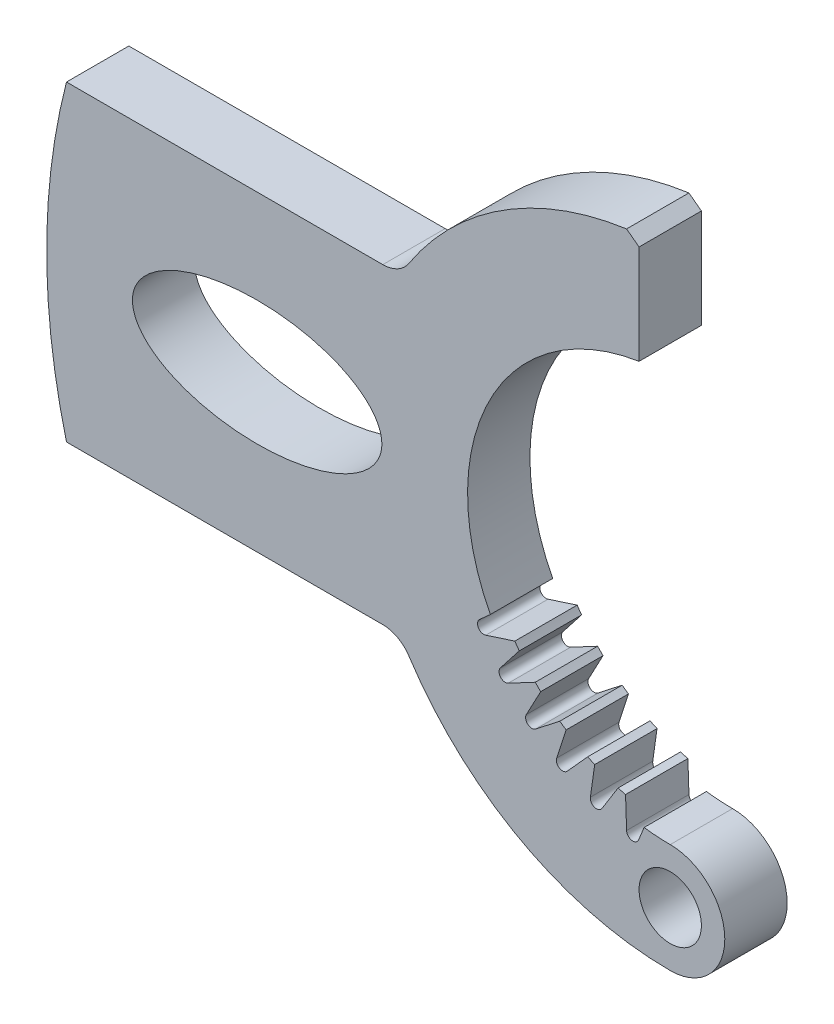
ISO-10303-21;
HEADER;
FILE_DESCRIPTION(('STEP AP214'),'2;1');
FILE_NAME('part.step','',(''),(''),'','','');
FILE_SCHEMA(('AUTOMOTIVE_DESIGN { 1 0 10303 214 1 1 1 1 }'));
ENDSEC;
DATA;
#1=APPLICATION_CONTEXT('core data for automotive mechanical design processes');
#2=APPLICATION_PROTOCOL_DEFINITION('international standard','automotive_design',2000,#1);
#3=PRODUCT_CONTEXT('',#1,'mechanical');
#4=PRODUCT('Part','Part','',(#3));
#5=PRODUCT_RELATED_PRODUCT_CATEGORY('part','',(#4));
#6=PRODUCT_DEFINITION_FORMATION('','',#4);
#7=PRODUCT_DEFINITION_CONTEXT('part definition',#1,'design');
#8=PRODUCT_DEFINITION('design','',#6,#7);
#9=PRODUCT_DEFINITION_SHAPE('','',#8);
#10=(LENGTH_UNIT() NAMED_UNIT(*) SI_UNIT(.MILLI.,.METRE.));
#11=(NAMED_UNIT(*) PLANE_ANGLE_UNIT() SI_UNIT($,.RADIAN.));
#12=(NAMED_UNIT(*) SI_UNIT($,.STERADIAN.) SOLID_ANGLE_UNIT());
#13=UNCERTAINTY_MEASURE_WITH_UNIT(LENGTH_MEASURE(1.E-05),#10,'distance_accuracy_value','');
#14=(GEOMETRIC_REPRESENTATION_CONTEXT(3) GLOBAL_UNCERTAINTY_ASSIGNED_CONTEXT((#13)) GLOBAL_UNIT_ASSIGNED_CONTEXT((#10,
#11,#12)) REPRESENTATION_CONTEXT('',''));
#15=CARTESIAN_POINT('',(0.,0.,0.));
#16=DIRECTION('',(0.,0.,1.));
#17=DIRECTION('',(1.,0.,0.));
#18=AXIS2_PLACEMENT_3D('',#15,#16,#17);
#19=CARTESIAN_POINT('',(96.8245836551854,25.,10.));
#20=DIRECTION('',(0.,0.,1.));
#21=DIRECTION('',(1.,0.,0.));
#22=AXIS2_PLACEMENT_3D('',#19,#20,#21);
#23=PLANE('',#22);
#24=CARTESIAN_POINT('',(30.5745836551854,25.,10.));
#25=DIRECTION('',(0.,0.,1.));
#26=DIRECTION('',(1.,0.,0.));
#27=AXIS2_PLACEMENT_3D('',#24,#25,#26);
#28=ELLIPSE('',#27,20.,10.);
#29=CARTESIAN_POINT('',(50.5745836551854,25.,10.));
#30=VERTEX_POINT('',#29);
#31=EDGE_CURVE('E296',#30,#30,#28,.T.);
#32=ORIENTED_EDGE('',*,*,#31,.F.);
#33=EDGE_LOOP('',(#32));
#34=FACE_BOUND('',#33,.T.);
#35=CARTESIAN_POINT('',(96.8245836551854,25.,10.));
#36=DIRECTION('',(0.,0.,1.));
#37=DIRECTION('',(1.,0.,0.));
#38=AXIS2_PLACEMENT_3D('',#35,#36,#37);
#39=CIRCLE('',#38,100.);
#40=CARTESIAN_POINT('',(0.,50.,10.));
#41=VERTEX_POINT('',#40);
#42=CARTESIAN_POINT('',(0.,0.,10.));
#43=VERTEX_POINT('',#42);
#44=EDGE_CURVE('E361',#41,#43,#39,.T.);
#45=ORIENTED_EDGE('',*,*,#44,.T.);
#46=DIRECTION('',(1.,0.,0.));
#47=VECTOR('',#46,1.);
#48=CARTESIAN_POINT('',(0.,0.,10.));
#49=LINE('',#48,#47);
#50=CARTESIAN_POINT('',(50.726861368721,0.,10.));
#51=VERTEX_POINT('',#50);
#52=EDGE_CURVE('E174',#43,#51,#49,.T.);
#53=ORIENTED_EDGE('',*,*,#52,.T.);
#54=CARTESIAN_POINT('',(50.726861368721,-5.,10.));
#55=DIRECTION('',(0.,0.,-1.));
#56=DIRECTION('',(-1.,0.,0.));
#57=AXIS2_PLACEMENT_3D('',#54,#55,#56);
#58=CIRCLE('',#57,5.);
#59=CARTESIAN_POINT('',(54.9175633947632,-2.27272727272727,10.));
#60=VERTEX_POINT('',#59);
#61=EDGE_CURVE('E457',#51,#60,#58,.T.);
#62=ORIENTED_EDGE('',*,*,#61,.T.);
#63=CARTESIAN_POINT('',(96.8245836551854,25.,10.));
#64=DIRECTION('',(0.,0.,1.));
#65=DIRECTION('',(1.,0.,0.));
#66=AXIS2_PLACEMENT_3D('',#63,#64,#65);
#67=CIRCLE('',#66,50.);
#68=CARTESIAN_POINT('',(96.8245836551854,-25.,10.));
#69=VERTEX_POINT('',#68);
#70=EDGE_CURVE('E476',#60,#69,#67,.T.);
#71=ORIENTED_EDGE('',*,*,#70,.T.);
#72=CARTESIAN_POINT('',(96.8245836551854,-16.25,10.));
#73=DIRECTION('',(0.,0.,1.));
#74=DIRECTION('',(-1.,0.,0.));
#75=AXIS2_PLACEMENT_3D('',#72,#73,#74);
#76=CIRCLE('',#75,8.74999999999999);
#77=CARTESIAN_POINT('',(96.8245836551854,-7.49999999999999,10.));
#78=VERTEX_POINT('',#77);
#79=EDGE_CURVE('E473',#69,#78,#76,.T.);
#80=ORIENTED_EDGE('',*,*,#79,.T.);
#81=CARTESIAN_POINT('',(96.8245836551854,25.,10.));
#82=DIRECTION('',(0.,0.,-1.));
#83=DIRECTION('',(1.,0.,0.));
#84=AXIS2_PLACEMENT_3D('',#81,#82,#83);
#85=CIRCLE('',#84,32.5);
#86=CARTESIAN_POINT('',(92.6259341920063,-7.22764873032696,10.));
#87=VERTEX_POINT('',#86);
#88=EDGE_CURVE('E475',#78,#87,#85,.T.);
#89=ORIENTED_EDGE('',*,*,#88,.T.);
#90=DIRECTION('',(-0.374606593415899,-0.927183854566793,0.));
#91=VECTOR('',#90,1.);
#92=CARTESIAN_POINT('',(91.755212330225,-9.38276096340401,10.));
#93=LINE('',#92,#91);
#94=CARTESIAN_POINT('',(91.755212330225,-9.38276096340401,10.));
#95=VERTEX_POINT('',#94);
#96=EDGE_CURVE('E478',#87,#95,#93,.T.);
#97=ORIENTED_EDGE('',*,*,#96,.T.);
#98=CARTESIAN_POINT('',(90.8280284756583,-9.00815436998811,10.));
#99=DIRECTION('',(0.,0.,-1.));
#100=DIRECTION('',(1.,0.,0.));
#101=AXIS2_PLACEMENT_3D('',#98,#99,#100);
#102=CIRCLE('',#101,0.999999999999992);
#103=CARTESIAN_POINT('',(89.8286376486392,-9.04305386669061,10.));
#104=VERTEX_POINT('',#103);
#105=EDGE_CURVE('E484',#95,#104,#102,.T.);
#106=ORIENTED_EDGE('',*,*,#105,.T.);
#107=DIRECTION('',(-0.0348994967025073,0.999390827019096,0.));
#108=VECTOR('',#107,1.);
#109=CARTESIAN_POINT('',(89.6571122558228,-4.13120927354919,10.));
#110=LINE('',#109,#108);
#111=CARTESIAN_POINT('',(89.6571122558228,-4.13120927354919,10.));
#112=VERTEX_POINT('',#111);
#113=EDGE_CURVE('E486',#104,#112,#110,.T.);
#114=ORIENTED_EDGE('',*,*,#113,.T.);
#115=CARTESIAN_POINT('',(96.8245836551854,25.,10.));
#116=DIRECTION('',(0.,0.,-1.));
#117=DIRECTION('',(1.,0.,0.));
#118=AXIS2_PLACEMENT_3D('',#115,#116,#117);
#119=CIRCLE('',#118,30.);
#120=CARTESIAN_POINT('',(88.4661913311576,-3.81210297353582,10.));
#121=VERTEX_POINT('',#120);
#122=EDGE_CURVE('E488',#112,#121,#119,.T.);
#123=ORIENTED_EDGE('',*,*,#122,.T.);
#124=DIRECTION('',(-0.529919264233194,-0.848048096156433,0.));
#125=VECTOR('',#124,1.);
#126=CARTESIAN_POINT('',(85.8617236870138,-7.98012247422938,10.));
#127=LINE('',#126,#125);
#128=CARTESIAN_POINT('',(85.8617236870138,-7.98012247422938,10.));
#129=VERTEX_POINT('',#128);
#130=EDGE_CURVE('E490',#121,#129,#127,.T.);
#131=ORIENTED_EDGE('',*,*,#130,.T.);
#132=CARTESIAN_POINT('',(85.0136755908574,-7.45020320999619,10.));
#133=DIRECTION('',(0.,0.,-1.));
#134=DIRECTION('',(1.,0.,0.));
#135=AXIS2_PLACEMENT_3D('',#132,#133,#134);
#136=CIRCLE('',#135,0.999999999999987);
#137=CARTESIAN_POINT('',(84.0234075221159,-7.31103010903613,10.));
#138=VERTEX_POINT('',#137);
#139=EDGE_CURVE('E492',#129,#138,#136,.T.);
#140=ORIENTED_EDGE('',*,*,#139,.T.);
#141=DIRECTION('',(0.139173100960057,0.990268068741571,0.));
#142=VECTOR('',#141,1.);
#143=CARTESIAN_POINT('',(84.707420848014,-2.4440224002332,10.));
#144=LINE('',#143,#142);
#145=CARTESIAN_POINT('',(84.707420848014,-2.4440224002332,10.));
#146=VERTEX_POINT('',#145);
#147=EDGE_CURVE('E494',#138,#146,#144,.T.);
#148=ORIENTED_EDGE('',*,*,#147,.T.);
#149=CARTESIAN_POINT('',(96.8245836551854,25.,10.));
#150=DIRECTION('',(0.,0.,-1.));
#151=DIRECTION('',(1.,0.,0.));
#152=AXIS2_PLACEMENT_3D('',#149,#150,#151);
#153=CIRCLE('',#152,30.);
#154=CARTESIAN_POINT('',(83.5900052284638,-1.92296294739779,10.));
#155=VERTEX_POINT('',#154);
#156=EDGE_CURVE('E496',#146,#155,#153,.T.);
#157=ORIENTED_EDGE('',*,*,#156,.T.);
#158=DIRECTION('',(-0.66913065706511,-0.743144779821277,0.));
#159=VECTOR('',#158,1.);
#160=CARTESIAN_POINT('',(83.5900052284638,-1.92296294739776,10.));
#161=LINE('',#160,#159);
#162=CARTESIAN_POINT('',(80.3013359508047,-5.57539970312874,10.));
#163=VERTEX_POINT('',#162);
#164=EDGE_CURVE('E498',#155,#163,#161,.T.);
#165=ORIENTED_EDGE('',*,*,#164,.T.);
#166=CARTESIAN_POINT('',(79.5581911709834,-4.90626904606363,10.));
#167=DIRECTION('',(0.,0.,-1.));
#168=DIRECTION('',(1.,0.,0.));
#169=AXIS2_PLACEMENT_3D('',#166,#167,#168);
#170=CIRCLE('',#169,0.999999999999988);
#171=CARTESIAN_POINT('',(78.6071346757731,-4.59725198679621,10.));
#172=VERTEX_POINT('',#171);
#173=EDGE_CURVE('E500',#163,#172,#170,.T.);
#174=ORIENTED_EDGE('',*,*,#173,.T.);
#175=DIRECTION('',(0.309017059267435,0.951056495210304,0.));
#176=VECTOR('',#175,1.);
#177=CARTESIAN_POINT('',(80.125903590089,0.0770370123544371,10.));
#178=LINE('',#177,#176);
#179=CARTESIAN_POINT('',(80.125903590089,0.0770370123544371,10.));
#180=VERTEX_POINT('',#179);
#181=EDGE_CURVE('E502',#172,#180,#178,.T.);
#182=ORIENTED_EDGE('',*,*,#181,.T.);
#183=CARTESIAN_POINT('',(96.8245836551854,25.,10.));
#184=DIRECTION('',(0.,0.,-1.));
#185=DIRECTION('',(1.,0.,0.));
#186=AXIS2_PLACEMENT_3D('',#183,#184,#185);
#187=CIRCLE('',#186,30.);
#188=CARTESIAN_POINT('',(79.1159444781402,0.784217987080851,10.));
#189=VERTEX_POINT('',#188);
#190=EDGE_CURVE('E504',#180,#189,#187,.T.);
#191=ORIENTED_EDGE('',*,*,#190,.T.);
#192=DIRECTION('',(-0.788010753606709,-0.615661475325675,0.));
#193=VECTOR('',#192,1.);
#194=CARTESIAN_POINT('',(75.2429988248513,-2.24165878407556,10.));
#195=LINE('',#194,#193);
#196=CARTESIAN_POINT('',(75.2429988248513,-2.24165878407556,10.));
#197=VERTEX_POINT('',#196);
#198=EDGE_CURVE('E506',#189,#197,#195,.T.);
#199=ORIENTED_EDGE('',*,*,#198,.T.);
#200=CARTESIAN_POINT('',(74.6273373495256,-1.4536480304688,10.));
#201=DIRECTION('',(0.,0.,-1.));
#202=DIRECTION('',(1.,0.,0.));
#203=AXIS2_PLACEMENT_3D('',#200,#201,#202);
#204=CIRCLE('',#203,1.00000000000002);
#205=CARTESIAN_POINT('',(73.7443897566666,-0.984176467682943,10.));
#206=VERTEX_POINT('',#205);
#207=EDGE_CURVE('E508',#197,#206,#204,.T.);
#208=ORIENTED_EDGE('',*,*,#207,.T.);
#209=DIRECTION('',(0.469471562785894,0.882947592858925,0.));
#210=VECTOR('',#209,1.);
#211=CARTESIAN_POINT('',(76.0517667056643,3.35536842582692,10.));
#212=LINE('',#211,#210);
#213=CARTESIAN_POINT('',(76.0517667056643,3.35536842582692,10.));
#214=VERTEX_POINT('',#213);
#215=EDGE_CURVE('E510',#206,#214,#212,.T.);
#216=ORIENTED_EDGE('',*,*,#215,.T.);
#217=CARTESIAN_POINT('',(96.824583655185,25.0000000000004,10.));
#218=DIRECTION('',(0.,0.,-1.));
#219=DIRECTION('',(1.,0.,0.));
#220=AXIS2_PLACEMENT_3D('',#217,#218,#219);
#221=CIRCLE('',#220,30.);
#222=CARTESIAN_POINT('',(75.1799520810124,4.22718305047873,10.));
#223=VERTEX_POINT('',#222);
#224=EDGE_CURVE('E512',#214,#223,#221,.T.);
#225=ORIENTED_EDGE('',*,*,#224,.T.);
#226=DIRECTION('',(-0.882947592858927,-0.469471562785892,0.));
#227=VECTOR('',#226,1.);
#228=CARTESIAN_POINT('',(70.8404071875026,1.91980610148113,10.));
#229=LINE('',#228,#227);
#230=CARTESIAN_POINT('',(70.8404071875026,1.91980610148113,10.));
#231=VERTEX_POINT('',#230);
#232=EDGE_CURVE('E514',#223,#231,#229,.T.);
#233=ORIENTED_EDGE('',*,*,#232,.T.);
#234=CARTESIAN_POINT('',(70.3709356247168,2.80275369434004,10.));
#235=DIRECTION('',(0.,0.,-1.));
#236=DIRECTION('',(1.,0.,0.));
#237=AXIS2_PLACEMENT_3D('',#234,#235,#236);
#238=CIRCLE('',#237,0.999999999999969);
#239=CARTESIAN_POINT('',(69.58292487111,3.41841516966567,10.));
#240=VERTEX_POINT('',#239);
#241=EDGE_CURVE('E516',#231,#240,#238,.T.);
#242=ORIENTED_EDGE('',*,*,#241,.T.);
#243=DIRECTION('',(0.615661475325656,0.788010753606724,0.));
#244=VECTOR('',#243,1.);
#245=CARTESIAN_POINT('',(72.6088016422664,7.29136082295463,10.));
#246=LINE('',#245,#244);
#247=CARTESIAN_POINT('',(72.6088016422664,7.29136082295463,10.));
#248=VERTEX_POINT('',#247);
#249=EDGE_CURVE('E518',#240,#248,#246,.T.);
#250=ORIENTED_EDGE('',*,*,#249,.T.);
#251=CARTESIAN_POINT('',(96.8245836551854,25.,10.));
#252=DIRECTION('',(0.,0.,-1.));
#253=DIRECTION('',(1.,0.,0.));
#254=AXIS2_PLACEMENT_3D('',#251,#252,#253);
#255=CIRCLE('',#254,30.);
#256=CARTESIAN_POINT('',(71.901620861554,8.30131964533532,10.));
#257=VERTEX_POINT('',#256);
#258=EDGE_CURVE('E520',#248,#257,#255,.T.);
#259=ORIENTED_EDGE('',*,*,#258,.T.);
#260=DIRECTION('',(-0.951056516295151,-0.309016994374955,0.));
#261=VECTOR('',#260,1.);
#262=CARTESIAN_POINT('',(67.2273316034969,6.7825509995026,10.));
#263=LINE('',#262,#261);
#264=CARTESIAN_POINT('',(67.2273316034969,6.7825509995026,10.));
#265=VERTEX_POINT('',#264);
#266=EDGE_CURVE('E522',#257,#265,#263,.T.);
#267=ORIENTED_EDGE('',*,*,#266,.T.);
#268=CARTESIAN_POINT('',(66.9183146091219,7.73360751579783,10.));
#269=DIRECTION('',(0.,0.,-1.));
#270=DIRECTION('',(1.,0.,0.));
#271=AXIS2_PLACEMENT_3D('',#268,#269,#270);
#272=CIRCLE('',#271,1.00000000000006);
#273=CARTESIAN_POINT('',(66.249184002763,8.47675234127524,10.));
#274=VERTEX_POINT('',#273);
#275=EDGE_CURVE('E524',#265,#274,#272,.T.);
#276=ORIENTED_EDGE('',*,*,#275,.T.);
#277=DIRECTION('',(0.743144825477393,0.66913060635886,0.));
#278=VECTOR('',#277,1.);
#279=CARTESIAN_POINT('',(67.9765226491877,10.032055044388,10.));
#280=LINE('',#279,#278);
#281=CARTESIAN_POINT('',(67.9765226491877,10.032055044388,10.));
#282=VERTEX_POINT('',#281);
#283=EDGE_CURVE('E526',#274,#282,#280,.T.);
#284=ORIENTED_EDGE('',*,*,#283,.T.);
#285=CARTESIAN_POINT('',(96.8245836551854,25.,10.));
#286=DIRECTION('',(0.,0.,-1.));
#287=DIRECTION('',(1.,0.,0.));
#288=AXIS2_PLACEMENT_3D('',#285,#286,#287);
#289=CIRCLE('',#288,32.5);
#290=CARTESIAN_POINT('',(91.8245836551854,57.1130814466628,10.));
#291=VERTEX_POINT('',#290);
#292=EDGE_CURVE('E528',#282,#291,#289,.T.);
#293=ORIENTED_EDGE('',*,*,#292,.T.);
#294=DIRECTION('',(0.,1.,0.));
#295=VECTOR('',#294,1.);
#296=CARTESIAN_POINT('',(91.8245836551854,73.,10.));
#297=LINE('',#296,#295);
#298=CARTESIAN_POINT('',(91.8245836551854,73.,10.));
#299=VERTEX_POINT('',#298);
#300=EDGE_CURVE('E530',#291,#299,#297,.T.);
#301=ORIENTED_EDGE('',*,*,#300,.T.);
#302=DIRECTION('',(-0.798545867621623,0.60193396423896,0.));
#303=VECTOR('',#302,1.);
#304=CARTESIAN_POINT('',(89.8245836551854,74.5075751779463,10.));
#305=LINE('',#304,#303);
#306=CARTESIAN_POINT('',(89.8245836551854,74.5075751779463,10.));
#307=VERTEX_POINT('',#306);
#308=EDGE_CURVE('E274',#299,#307,#305,.T.);
#309=ORIENTED_EDGE('',*,*,#308,.T.);
#310=CARTESIAN_POINT('',(96.8245836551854,25.,10.));
#311=DIRECTION('',(0.,0.,1.));
#312=DIRECTION('',(1.,0.,0.));
#313=AXIS2_PLACEMENT_3D('',#310,#311,#312);
#314=CIRCLE('',#313,50.);
#315=CARTESIAN_POINT('',(54.9175633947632,52.2727272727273,10.));
#316=VERTEX_POINT('',#315);
#317=EDGE_CURVE('E268',#307,#316,#314,.T.);
#318=ORIENTED_EDGE('',*,*,#317,.T.);
#319=CARTESIAN_POINT('',(50.726861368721,55.,10.));
#320=DIRECTION('',(0.,0.,-1.));
#321=DIRECTION('',(1.,0.,0.));
#322=AXIS2_PLACEMENT_3D('',#319,#320,#321);
#323=CIRCLE('',#322,4.99999999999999);
#324=CARTESIAN_POINT('',(50.726861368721,50.,10.));
#325=VERTEX_POINT('',#324);
#326=EDGE_CURVE('E272',#316,#325,#323,.T.);
#327=ORIENTED_EDGE('',*,*,#326,.T.);
#328=DIRECTION('',(-1.,0.,0.));
#329=VECTOR('',#328,1.);
#330=CARTESIAN_POINT('',(0.,50.,10.));
#331=LINE('',#330,#329);
#332=EDGE_CURVE('E50',#325,#41,#331,.T.);
#333=ORIENTED_EDGE('',*,*,#332,.T.);
#334=EDGE_LOOP('',(#45,#53,#62,#71,#80,#89,#97,#106,#114,#123,#131,#140,#148,#157,#165,#174,
#182,#191,#199,#208,#216,#225,#233,#242,#250,#259,#267,#276,#284,#293,#301,#309,#318,#327,#333));
#335=FACE_BOUND('',#334,.T.);
#336=CARTESIAN_POINT('',(96.8245836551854,-16.25,10.));
#337=DIRECTION('',(0.,0.,1.));
#338=DIRECTION('',(1.,0.,0.));
#339=AXIS2_PLACEMENT_3D('',#336,#337,#338);
#340=CIRCLE('',#339,5.);
#341=CARTESIAN_POINT('',(101.824583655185,-16.25,10.));
#342=VERTEX_POINT('',#341);
#343=EDGE_CURVE('E575',#342,#342,#340,.T.);
#344=ORIENTED_EDGE('',*,*,#343,.F.);
#345=EDGE_LOOP('',(#344));
#346=FACE_BOUND('',#345,.T.);
#347=ADVANCED_FACE('F33',(#34,#335,#346),#23,.T.);
#348=CARTESIAN_POINT('',(96.8245836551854,25.,0.));
#349=DIRECTION('',(0.,0.,1.));
#350=DIRECTION('',(1.,0.,0.));
#351=AXIS2_PLACEMENT_3D('',#348,#349,#350);
#352=PLANE('',#351);
#353=CARTESIAN_POINT('',(96.8245836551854,25.,0.));
#354=DIRECTION('',(0.,0.,1.));
#355=DIRECTION('',(1.,0.,0.));
#356=AXIS2_PLACEMENT_3D('',#353,#354,#355);
#357=CIRCLE('',#356,100.);
#358=CARTESIAN_POINT('',(0.,50.,0.));
#359=VERTEX_POINT('',#358);
#360=CARTESIAN_POINT('',(0.,0.,0.));
#361=VERTEX_POINT('',#360);
#362=EDGE_CURVE('E292',#359,#361,#357,.T.);
#363=ORIENTED_EDGE('',*,*,#362,.F.);
#364=DIRECTION('',(-1.,0.,0.));
#365=VECTOR('',#364,1.);
#366=CARTESIAN_POINT('',(0.,50.,0.));
#367=LINE('',#366,#365);
#368=CARTESIAN_POINT('',(50.726861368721,50.,0.));
#369=VERTEX_POINT('',#368);
#370=EDGE_CURVE('E166',#369,#359,#367,.T.);
#371=ORIENTED_EDGE('',*,*,#370,.F.);
#372=CARTESIAN_POINT('',(50.726861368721,55.,0.));
#373=DIRECTION('',(0.,0.,-1.));
#374=DIRECTION('',(1.,0.,0.));
#375=AXIS2_PLACEMENT_3D('',#372,#373,#374);
#376=CIRCLE('',#375,4.99999999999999);
#377=CARTESIAN_POINT('',(54.9175633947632,52.2727272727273,0.));
#378=VERTEX_POINT('',#377);
#379=EDGE_CURVE('E160',#378,#369,#376,.T.);
#380=ORIENTED_EDGE('',*,*,#379,.F.);
#381=CARTESIAN_POINT('',(96.8245836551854,25.,0.));
#382=DIRECTION('',(0.,0.,1.));
#383=DIRECTION('',(1.,0.,0.));
#384=AXIS2_PLACEMENT_3D('',#381,#382,#383);
#385=CIRCLE('',#384,50.);
#386=CARTESIAN_POINT('',(89.8245836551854,74.5075751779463,0.));
#387=VERTEX_POINT('',#386);
#388=EDGE_CURVE('E282',#387,#378,#385,.T.);
#389=ORIENTED_EDGE('',*,*,#388,.F.);
#390=DIRECTION('',(-0.798545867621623,0.60193396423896,0.));
#391=VECTOR('',#390,1.);
#392=CARTESIAN_POINT('',(89.8245836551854,74.5075751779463,0.));
#393=LINE('',#392,#391);
#394=CARTESIAN_POINT('',(91.8245836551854,73.,0.));
#395=VERTEX_POINT('',#394);
#396=EDGE_CURVE('E356',#395,#387,#393,.T.);
#397=ORIENTED_EDGE('',*,*,#396,.F.);
#398=DIRECTION('',(0.,1.,0.));
#399=VECTOR('',#398,1.);
#400=CARTESIAN_POINT('',(91.8245836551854,73.,0.));
#401=LINE('',#400,#399);
#402=CARTESIAN_POINT('',(91.8245836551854,57.1130814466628,0.));
#403=VERTEX_POINT('',#402);
#404=EDGE_CURVE('E354',#403,#395,#401,.T.);
#405=ORIENTED_EDGE('',*,*,#404,.F.);
#406=CARTESIAN_POINT('',(96.8245836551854,25.,0.));
#407=DIRECTION('',(0.,0.,-1.));
#408=DIRECTION('',(1.,0.,0.));
#409=AXIS2_PLACEMENT_3D('',#406,#407,#408);
#410=CIRCLE('',#409,32.5);
#411=CARTESIAN_POINT('',(67.9765226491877,10.032055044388,0.));
#412=VERTEX_POINT('',#411);
#413=EDGE_CURVE('E352',#412,#403,#410,.T.);
#414=ORIENTED_EDGE('',*,*,#413,.F.);
#415=DIRECTION('',(0.743144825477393,0.66913060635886,0.));
#416=VECTOR('',#415,1.);
#417=CARTESIAN_POINT('',(67.9765226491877,10.032055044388,0.));
#418=LINE('',#417,#416);
#419=CARTESIAN_POINT('',(66.249184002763,8.47675234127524,0.));
#420=VERTEX_POINT('',#419);
#421=EDGE_CURVE('E350',#420,#412,#418,.T.);
#422=ORIENTED_EDGE('',*,*,#421,.F.);
#423=CARTESIAN_POINT('',(66.9183146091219,7.73360751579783,0.));
#424=DIRECTION('',(0.,0.,-1.));
#425=DIRECTION('',(1.,0.,0.));
#426=AXIS2_PLACEMENT_3D('',#423,#424,#425);
#427=CIRCLE('',#426,1.00000000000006);
#428=CARTESIAN_POINT('',(67.2273316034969,6.7825509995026,0.));
#429=VERTEX_POINT('',#428);
#430=EDGE_CURVE('E348',#429,#420,#427,.T.);
#431=ORIENTED_EDGE('',*,*,#430,.F.);
#432=DIRECTION('',(-0.951056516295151,-0.309016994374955,0.));
#433=VECTOR('',#432,1.);
#434=CARTESIAN_POINT('',(67.2273316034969,6.7825509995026,0.));
#435=LINE('',#434,#433);
#436=CARTESIAN_POINT('',(71.901620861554,8.30131964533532,0.));
#437=VERTEX_POINT('',#436);
#438=EDGE_CURVE('E346',#437,#429,#435,.T.);
#439=ORIENTED_EDGE('',*,*,#438,.F.);
#440=CARTESIAN_POINT('',(96.8245836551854,25.,0.));
#441=DIRECTION('',(0.,0.,-1.));
#442=DIRECTION('',(1.,0.,0.));
#443=AXIS2_PLACEMENT_3D('',#440,#441,#442);
#444=CIRCLE('',#443,30.);
#445=CARTESIAN_POINT('',(72.6088016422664,7.29136082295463,0.));
#446=VERTEX_POINT('',#445);
#447=EDGE_CURVE('E344',#446,#437,#444,.T.);
#448=ORIENTED_EDGE('',*,*,#447,.F.);
#449=DIRECTION('',(0.615661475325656,0.788010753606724,0.));
#450=VECTOR('',#449,1.);
#451=CARTESIAN_POINT('',(72.6088016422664,7.29136082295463,0.));
#452=LINE('',#451,#450);
#453=CARTESIAN_POINT('',(69.58292487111,3.41841516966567,0.));
#454=VERTEX_POINT('',#453);
#455=EDGE_CURVE('E342',#454,#446,#452,.T.);
#456=ORIENTED_EDGE('',*,*,#455,.F.);
#457=CARTESIAN_POINT('',(70.3709356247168,2.80275369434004,0.));
#458=DIRECTION('',(0.,0.,-1.));
#459=DIRECTION('',(1.,0.,0.));
#460=AXIS2_PLACEMENT_3D('',#457,#458,#459);
#461=CIRCLE('',#460,0.999999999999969);
#462=CARTESIAN_POINT('',(70.8404071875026,1.91980610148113,0.));
#463=VERTEX_POINT('',#462);
#464=EDGE_CURVE('E340',#463,#454,#461,.T.);
#465=ORIENTED_EDGE('',*,*,#464,.F.);
#466=DIRECTION('',(-0.882947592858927,-0.469471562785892,0.));
#467=VECTOR('',#466,1.);
#468=CARTESIAN_POINT('',(70.8404071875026,1.91980610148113,0.));
#469=LINE('',#468,#467);
#470=CARTESIAN_POINT('',(75.1799520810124,4.22718305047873,0.));
#471=VERTEX_POINT('',#470);
#472=EDGE_CURVE('E338',#471,#463,#469,.T.);
#473=ORIENTED_EDGE('',*,*,#472,.F.);
#474=CARTESIAN_POINT('',(96.824583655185,25.0000000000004,0.));
#475=DIRECTION('',(0.,0.,-1.));
#476=DIRECTION('',(1.,0.,0.));
#477=AXIS2_PLACEMENT_3D('',#474,#475,#476);
#478=CIRCLE('',#477,30.);
#479=CARTESIAN_POINT('',(76.0517667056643,3.35536842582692,0.));
#480=VERTEX_POINT('',#479);
#481=EDGE_CURVE('E336',#480,#471,#478,.T.);
#482=ORIENTED_EDGE('',*,*,#481,.F.);
#483=DIRECTION('',(0.469471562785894,0.882947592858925,0.));
#484=VECTOR('',#483,1.);
#485=CARTESIAN_POINT('',(76.0517667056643,3.35536842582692,0.));
#486=LINE('',#485,#484);
#487=CARTESIAN_POINT('',(73.7443897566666,-0.984176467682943,0.));
#488=VERTEX_POINT('',#487);
#489=EDGE_CURVE('E334',#488,#480,#486,.T.);
#490=ORIENTED_EDGE('',*,*,#489,.F.);
#491=CARTESIAN_POINT('',(74.6273373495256,-1.4536480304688,0.));
#492=DIRECTION('',(0.,0.,-1.));
#493=DIRECTION('',(1.,0.,0.));
#494=AXIS2_PLACEMENT_3D('',#491,#492,#493);
#495=CIRCLE('',#494,1.00000000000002);
#496=CARTESIAN_POINT('',(75.2429988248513,-2.24165878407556,0.));
#497=VERTEX_POINT('',#496);
#498=EDGE_CURVE('E332',#497,#488,#495,.T.);
#499=ORIENTED_EDGE('',*,*,#498,.F.);
#500=DIRECTION('',(-0.788010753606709,-0.615661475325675,0.));
#501=VECTOR('',#500,1.);
#502=CARTESIAN_POINT('',(75.2429988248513,-2.24165878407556,0.));
#503=LINE('',#502,#501);
#504=CARTESIAN_POINT('',(79.1159444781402,0.784217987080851,0.));
#505=VERTEX_POINT('',#504);
#506=EDGE_CURVE('E330',#505,#497,#503,.T.);
#507=ORIENTED_EDGE('',*,*,#506,.F.);
#508=CARTESIAN_POINT('',(96.8245836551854,25.,0.));
#509=DIRECTION('',(0.,0.,-1.));
#510=DIRECTION('',(1.,0.,0.));
#511=AXIS2_PLACEMENT_3D('',#508,#509,#510);
#512=CIRCLE('',#511,30.);
#513=CARTESIAN_POINT('',(80.125903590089,0.0770370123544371,0.));
#514=VERTEX_POINT('',#513);
#515=EDGE_CURVE('E328',#514,#505,#512,.T.);
#516=ORIENTED_EDGE('',*,*,#515,.F.);
#517=DIRECTION('',(0.309017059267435,0.951056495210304,0.));
#518=VECTOR('',#517,1.);
#519=CARTESIAN_POINT('',(80.125903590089,0.0770370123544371,0.));
#520=LINE('',#519,#518);
#521=CARTESIAN_POINT('',(78.6071346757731,-4.59725198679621,0.));
#522=VERTEX_POINT('',#521);
#523=EDGE_CURVE('E326',#522,#514,#520,.T.);
#524=ORIENTED_EDGE('',*,*,#523,.F.);
#525=CARTESIAN_POINT('',(79.5581911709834,-4.90626904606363,0.));
#526=DIRECTION('',(0.,0.,-1.));
#527=DIRECTION('',(1.,0.,0.));
#528=AXIS2_PLACEMENT_3D('',#525,#526,#527);
#529=CIRCLE('',#528,0.999999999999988);
#530=CARTESIAN_POINT('',(80.3013359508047,-5.57539970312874,0.));
#531=VERTEX_POINT('',#530);
#532=EDGE_CURVE('E324',#531,#522,#529,.T.);
#533=ORIENTED_EDGE('',*,*,#532,.F.);
#534=DIRECTION('',(-0.66913065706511,-0.743144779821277,0.));
#535=VECTOR('',#534,1.);
#536=CARTESIAN_POINT('',(83.5900052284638,-1.92296294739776,0.));
#537=LINE('',#536,#535);
#538=CARTESIAN_POINT('',(83.5900052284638,-1.92296294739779,0.));
#539=VERTEX_POINT('',#538);
#540=EDGE_CURVE('E322',#539,#531,#537,.T.);
#541=ORIENTED_EDGE('',*,*,#540,.F.);
#542=CARTESIAN_POINT('',(96.8245836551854,25.,0.));
#543=DIRECTION('',(0.,0.,-1.));
#544=DIRECTION('',(1.,0.,0.));
#545=AXIS2_PLACEMENT_3D('',#542,#543,#544);
#546=CIRCLE('',#545,30.);
#547=CARTESIAN_POINT('',(84.707420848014,-2.4440224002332,0.));
#548=VERTEX_POINT('',#547);
#549=EDGE_CURVE('E320',#548,#539,#546,.T.);
#550=ORIENTED_EDGE('',*,*,#549,.F.);
#551=DIRECTION('',(0.139173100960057,0.990268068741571,0.));
#552=VECTOR('',#551,1.);
#553=CARTESIAN_POINT('',(84.707420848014,-2.4440224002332,0.));
#554=LINE('',#553,#552);
#555=CARTESIAN_POINT('',(84.0234075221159,-7.31103010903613,0.));
#556=VERTEX_POINT('',#555);
#557=EDGE_CURVE('E318',#556,#548,#554,.T.);
#558=ORIENTED_EDGE('',*,*,#557,.F.);
#559=CARTESIAN_POINT('',(85.0136755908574,-7.45020320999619,0.));
#560=DIRECTION('',(0.,0.,-1.));
#561=DIRECTION('',(1.,0.,0.));
#562=AXIS2_PLACEMENT_3D('',#559,#560,#561);
#563=CIRCLE('',#562,0.999999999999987);
#564=CARTESIAN_POINT('',(85.8617236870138,-7.98012247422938,0.));
#565=VERTEX_POINT('',#564);
#566=EDGE_CURVE('E316',#565,#556,#563,.T.);
#567=ORIENTED_EDGE('',*,*,#566,.F.);
#568=DIRECTION('',(-0.529919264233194,-0.848048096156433,0.));
#569=VECTOR('',#568,1.);
#570=CARTESIAN_POINT('',(85.8617236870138,-7.98012247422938,0.));
#571=LINE('',#570,#569);
#572=CARTESIAN_POINT('',(88.4661913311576,-3.81210297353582,0.));
#573=VERTEX_POINT('',#572);
#574=EDGE_CURVE('E314',#573,#565,#571,.T.);
#575=ORIENTED_EDGE('',*,*,#574,.F.);
#576=CARTESIAN_POINT('',(96.8245836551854,25.,0.));
#577=DIRECTION('',(0.,0.,-1.));
#578=DIRECTION('',(1.,0.,0.));
#579=AXIS2_PLACEMENT_3D('',#576,#577,#578);
#580=CIRCLE('',#579,30.);
#581=CARTESIAN_POINT('',(89.6571122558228,-4.13120927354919,0.));
#582=VERTEX_POINT('',#581);
#583=EDGE_CURVE('E312',#582,#573,#580,.T.);
#584=ORIENTED_EDGE('',*,*,#583,.F.);
#585=DIRECTION('',(-0.0348994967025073,0.999390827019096,0.));
#586=VECTOR('',#585,1.);
#587=CARTESIAN_POINT('',(89.6571122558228,-4.13120927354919,0.));
#588=LINE('',#587,#586);
#589=CARTESIAN_POINT('',(89.8286376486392,-9.04305386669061,0.));
#590=VERTEX_POINT('',#589);
#591=EDGE_CURVE('E310',#590,#582,#588,.T.);
#592=ORIENTED_EDGE('',*,*,#591,.F.);
#593=CARTESIAN_POINT('',(90.8280284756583,-9.00815436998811,0.));
#594=DIRECTION('',(0.,0.,-1.));
#595=DIRECTION('',(1.,0.,0.));
#596=AXIS2_PLACEMENT_3D('',#593,#594,#595);
#597=CIRCLE('',#596,0.999999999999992);
#598=CARTESIAN_POINT('',(91.755212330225,-9.38276096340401,0.));
#599=VERTEX_POINT('',#598);
#600=EDGE_CURVE('E308',#599,#590,#597,.T.);
#601=ORIENTED_EDGE('',*,*,#600,.F.);
#602=DIRECTION('',(-0.374606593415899,-0.927183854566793,0.));
#603=VECTOR('',#602,1.);
#604=CARTESIAN_POINT('',(91.755212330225,-9.38276096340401,0.));
#605=LINE('',#604,#603);
#606=CARTESIAN_POINT('',(92.6259341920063,-7.22764873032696,0.));
#607=VERTEX_POINT('',#606);
#608=EDGE_CURVE('E306',#607,#599,#605,.T.);
#609=ORIENTED_EDGE('',*,*,#608,.F.);
#610=CARTESIAN_POINT('',(96.8245836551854,25.,0.));
#611=DIRECTION('',(0.,0.,-1.));
#612=DIRECTION('',(1.,0.,0.));
#613=AXIS2_PLACEMENT_3D('',#610,#611,#612);
#614=CIRCLE('',#613,32.5);
#615=CARTESIAN_POINT('',(96.8245836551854,-7.49999999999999,0.));
#616=VERTEX_POINT('',#615);
#617=EDGE_CURVE('E304',#616,#607,#614,.T.);
#618=ORIENTED_EDGE('',*,*,#617,.F.);
#619=CARTESIAN_POINT('',(96.8245836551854,-16.25,0.));
#620=DIRECTION('',(0.,0.,1.));
#621=DIRECTION('',(-1.,0.,0.));
#622=AXIS2_PLACEMENT_3D('',#619,#620,#621);
#623=CIRCLE('',#622,8.74999999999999);
#624=CARTESIAN_POINT('',(96.8245836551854,-25.,0.));
#625=VERTEX_POINT('',#624);
#626=EDGE_CURVE('E302',#625,#616,#623,.T.);
#627=ORIENTED_EDGE('',*,*,#626,.F.);
#628=CARTESIAN_POINT('',(96.8245836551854,25.,0.));
#629=DIRECTION('',(0.,0.,1.));
#630=DIRECTION('',(1.,0.,0.));
#631=AXIS2_PLACEMENT_3D('',#628,#629,#630);
#632=CIRCLE('',#631,50.);
#633=CARTESIAN_POINT('',(54.9175633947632,-2.27272727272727,0.));
#634=VERTEX_POINT('',#633);
#635=EDGE_CURVE('E300',#634,#625,#632,.T.);
#636=ORIENTED_EDGE('',*,*,#635,.F.);
#637=CARTESIAN_POINT('',(50.726861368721,-5.,0.));
#638=DIRECTION('',(0.,0.,-1.));
#639=DIRECTION('',(-1.,0.,0.));
#640=AXIS2_PLACEMENT_3D('',#637,#638,#639);
#641=CIRCLE('',#640,5.);
#642=CARTESIAN_POINT('',(50.726861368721,0.,0.));
#643=VERTEX_POINT('',#642);
#644=EDGE_CURVE('E298',#643,#634,#641,.T.);
#645=ORIENTED_EDGE('',*,*,#644,.F.);
#646=DIRECTION('',(1.,0.,0.));
#647=VECTOR('',#646,1.);
#648=CARTESIAN_POINT('',(0.,0.,0.));
#649=LINE('',#648,#647);
#650=EDGE_CURVE('E295',#361,#643,#649,.T.);
#651=ORIENTED_EDGE('',*,*,#650,.F.);
#652=EDGE_LOOP('',(#363,#371,#380,#389,#397,#405,#414,#422,#431,#439,#448,#456,#465,#473,#482,
#490,#499,#507,#516,#524,#533,#541,#550,#558,#567,#575,#584,#592,#601,#609,#618,#627,#636,#645,#651));
#653=FACE_BOUND('',#652,.T.);
#654=CARTESIAN_POINT('',(30.5745836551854,25.,0.));
#655=DIRECTION('',(0.,0.,1.));
#656=DIRECTION('',(1.,0.,0.));
#657=AXIS2_PLACEMENT_3D('',#654,#655,#656);
#658=ELLIPSE('',#657,20.,10.);
#659=CARTESIAN_POINT('',(50.5745836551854,25.,0.));
#660=VERTEX_POINT('',#659);
#661=EDGE_CURVE('E570',#660,#660,#658,.T.);
#662=ORIENTED_EDGE('',*,*,#661,.T.);
#663=EDGE_LOOP('',(#662));
#664=FACE_BOUND('',#663,.T.);
#665=CARTESIAN_POINT('',(96.8245836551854,-16.25,0.));
#666=DIRECTION('',(0.,0.,1.));
#667=DIRECTION('',(1.,0.,0.));
#668=AXIS2_PLACEMENT_3D('',#665,#666,#667);
#669=CIRCLE('',#668,5.);
#670=CARTESIAN_POINT('',(101.824583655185,-16.25,0.));
#671=VERTEX_POINT('',#670);
#672=EDGE_CURVE('E571',#671,#671,#669,.T.);
#673=ORIENTED_EDGE('',*,*,#672,.T.);
#674=EDGE_LOOP('',(#673));
#675=FACE_BOUND('',#674,.T.);
#676=ADVANCED_FACE('F461',(#653,#664,#675),#352,.F.);
#677=CARTESIAN_POINT('',(96.8245836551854,25.,10.));
#678=DIRECTION('',(0.,0.,-1.));
#679=DIRECTION('',(-1.,0.,0.));
#680=AXIS2_PLACEMENT_3D('',#677,#678,#679);
#681=CYLINDRICAL_SURFACE('',#680,100.);
#682=ORIENTED_EDGE('',*,*,#362,.T.);
#683=DIRECTION('',(0.,0.,-1.));
#684=VECTOR('',#683,1.);
#685=CARTESIAN_POINT('',(0.,0.,10.));
#686=LINE('',#685,#684);
#687=EDGE_CURVE('E11',#43,#361,#686,.T.);
#688=ORIENTED_EDGE('',*,*,#687,.F.);
#689=ORIENTED_EDGE('',*,*,#44,.F.);
#690=DIRECTION('',(0.,0.,-1.));
#691=VECTOR('',#690,1.);
#692=CARTESIAN_POINT('',(0.,50.,10.));
#693=LINE('',#692,#691);
#694=EDGE_CURVE('E288',#41,#359,#693,.T.);
#695=ORIENTED_EDGE('',*,*,#694,.T.);
#696=EDGE_LOOP('',(#682,#688,#689,#695));
#697=FACE_BOUND('',#696,.T.);
#698=ADVANCED_FACE('F35',(#697),#681,.T.);
#699=CARTESIAN_POINT('',(0.,0.,10.));
#700=DIRECTION('',(0.,1.,0.));
#701=DIRECTION('',(0.,0.,1.));
#702=AXIS2_PLACEMENT_3D('',#699,#700,#701);
#703=PLANE('',#702);
#704=ORIENTED_EDGE('',*,*,#650,.T.);
#705=DIRECTION('',(0.,0.,-1.));
#706=VECTOR('',#705,1.);
#707=CARTESIAN_POINT('',(50.726861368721,0.,10.));
#708=LINE('',#707,#706);
#709=EDGE_CURVE('E42',#51,#643,#708,.T.);
#710=ORIENTED_EDGE('',*,*,#709,.F.);
#711=ORIENTED_EDGE('',*,*,#52,.F.);
#712=ORIENTED_EDGE('',*,*,#687,.T.);
#713=EDGE_LOOP('',(#704,#710,#711,#712));
#714=FACE_BOUND('',#713,.T.);
#715=ADVANCED_FACE('F901',(#714),#703,.F.);
#716=CARTESIAN_POINT('',(50.726861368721,-5.,10.));
#717=DIRECTION('',(0.,0.,-1.));
#718=DIRECTION('',(-1.,0.,0.));
#719=AXIS2_PLACEMENT_3D('',#716,#717,#718);
#720=CYLINDRICAL_SURFACE('',#719,5.);
#721=ORIENTED_EDGE('',*,*,#644,.T.);
#722=DIRECTION('',(0.,0.,-1.));
#723=VECTOR('',#722,1.);
#724=CARTESIAN_POINT('',(54.9175633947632,-2.27272727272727,10.));
#725=LINE('',#724,#723);
#726=EDGE_CURVE('E449',#60,#634,#725,.T.);
#727=ORIENTED_EDGE('',*,*,#726,.F.);
#728=ORIENTED_EDGE('',*,*,#61,.F.);
#729=ORIENTED_EDGE('',*,*,#709,.T.);
#730=EDGE_LOOP('',(#721,#727,#728,#729));
#731=FACE_BOUND('',#730,.T.);
#732=ADVANCED_FACE('F455',(#731),#720,.F.);
#733=CARTESIAN_POINT('',(96.8245836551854,25.,10.));
#734=DIRECTION('',(0.,0.,-1.));
#735=DIRECTION('',(-1.,0.,0.));
#736=AXIS2_PLACEMENT_3D('',#733,#734,#735);
#737=CYLINDRICAL_SURFACE('',#736,50.);
#738=ORIENTED_EDGE('',*,*,#635,.T.);
#739=DIRECTION('',(0.,0.,-1.));
#740=VECTOR('',#739,1.);
#741=CARTESIAN_POINT('',(96.8245836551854,-25.,10.));
#742=LINE('',#741,#740);
#743=EDGE_CURVE('E446',#69,#625,#742,.T.);
#744=ORIENTED_EDGE('',*,*,#743,.F.);
#745=ORIENTED_EDGE('',*,*,#70,.F.);
#746=ORIENTED_EDGE('',*,*,#726,.T.);
#747=EDGE_LOOP('',(#738,#744,#745,#746));
#748=FACE_BOUND('',#747,.T.);
#749=ADVANCED_FACE('F467',(#748),#737,.T.);
#750=CARTESIAN_POINT('',(96.8245836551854,-16.25,10.));
#751=DIRECTION('',(0.,0.,-1.));
#752=DIRECTION('',(-1.,0.,0.));
#753=AXIS2_PLACEMENT_3D('',#750,#751,#752);
#754=CYLINDRICAL_SURFACE('',#753,8.74999999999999);
#755=ORIENTED_EDGE('',*,*,#626,.T.);
#756=DIRECTION('',(0.,0.,-1.));
#757=VECTOR('',#756,1.);
#758=CARTESIAN_POINT('',(96.8245836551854,-7.49999999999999,10.));
#759=LINE('',#758,#757);
#760=EDGE_CURVE('E443',#78,#616,#759,.T.);
#761=ORIENTED_EDGE('',*,*,#760,.F.);
#762=ORIENTED_EDGE('',*,*,#79,.F.);
#763=ORIENTED_EDGE('',*,*,#743,.T.);
#764=EDGE_LOOP('',(#755,#761,#762,#763));
#765=FACE_BOUND('',#764,.T.);
#766=ADVANCED_FACE('F471',(#765),#754,.T.);
#767=CARTESIAN_POINT('',(96.8245836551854,25.,10.));
#768=DIRECTION('',(0.,0.,-1.));
#769=DIRECTION('',(-1.,0.,0.));
#770=AXIS2_PLACEMENT_3D('',#767,#768,#769);
#771=CYLINDRICAL_SURFACE('',#770,32.5);
#772=ORIENTED_EDGE('',*,*,#617,.T.);
#773=DIRECTION('',(0.,0.,-1.));
#774=VECTOR('',#773,1.);
#775=CARTESIAN_POINT('',(92.6259341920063,-7.22764873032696,10.));
#776=LINE('',#775,#774);
#777=EDGE_CURVE('E440',#87,#607,#776,.T.);
#778=ORIENTED_EDGE('',*,*,#777,.F.);
#779=ORIENTED_EDGE('',*,*,#88,.F.);
#780=ORIENTED_EDGE('',*,*,#760,.T.);
#781=EDGE_LOOP('',(#772,#778,#779,#780));
#782=FACE_BOUND('',#781,.T.);
#783=ADVANCED_FACE('F866',(#782),#771,.F.);
#784=CARTESIAN_POINT('',(91.755212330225,-9.38276096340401,10.));
#785=DIRECTION('',(0.927183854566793,-0.374606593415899,0.));
#786=DIRECTION('',(0.374606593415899,0.927183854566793,0.));
#787=AXIS2_PLACEMENT_3D('',#784,#785,#786);
#788=PLANE('',#787);
#789=ORIENTED_EDGE('',*,*,#608,.T.);
#790=DIRECTION('',(0.,0.,-1.));
#791=VECTOR('',#790,1.);
#792=CARTESIAN_POINT('',(91.755212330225,-9.38276096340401,10.));
#793=LINE('',#792,#791);
#794=EDGE_CURVE('E437',#95,#599,#793,.T.);
#795=ORIENTED_EDGE('',*,*,#794,.F.);
#796=ORIENTED_EDGE('',*,*,#96,.F.);
#797=ORIENTED_EDGE('',*,*,#777,.T.);
#798=EDGE_LOOP('',(#789,#795,#796,#797));
#799=FACE_BOUND('',#798,.T.);
#800=ADVANCED_FACE('F856',(#799),#788,.F.);
#801=CARTESIAN_POINT('',(90.8280284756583,-9.00815436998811,10.));
#802=DIRECTION('',(0.,0.,-1.));
#803=DIRECTION('',(-1.,0.,0.));
#804=AXIS2_PLACEMENT_3D('',#801,#802,#803);
#805=CYLINDRICAL_SURFACE('',#804,0.999999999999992);
#806=ORIENTED_EDGE('',*,*,#600,.T.);
#807=DIRECTION('',(0.,0.,-1.));
#808=VECTOR('',#807,1.);
#809=CARTESIAN_POINT('',(89.8286376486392,-9.04305386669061,10.));
#810=LINE('',#809,#808);
#811=EDGE_CURVE('E434',#104,#590,#810,.T.);
#812=ORIENTED_EDGE('',*,*,#811,.F.);
#813=ORIENTED_EDGE('',*,*,#105,.F.);
#814=ORIENTED_EDGE('',*,*,#794,.T.);
#815=EDGE_LOOP('',(#806,#812,#813,#814));
#816=FACE_BOUND('',#815,.T.);
#817=ADVANCED_FACE('F846',(#816),#805,.F.);
#818=CARTESIAN_POINT('',(89.6571122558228,-4.13120927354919,10.));
#819=DIRECTION('',(-0.999390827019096,-0.0348994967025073,0.));
#820=DIRECTION('',(0.0348994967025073,-0.999390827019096,0.));
#821=AXIS2_PLACEMENT_3D('',#818,#819,#820);
#822=PLANE('',#821);
#823=ORIENTED_EDGE('',*,*,#591,.T.);
#824=DIRECTION('',(0.,0.,-1.));
#825=VECTOR('',#824,1.);
#826=CARTESIAN_POINT('',(89.6571122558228,-4.13120927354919,10.));
#827=LINE('',#826,#825);
#828=EDGE_CURVE('E431',#112,#582,#827,.T.);
#829=ORIENTED_EDGE('',*,*,#828,.F.);
#830=ORIENTED_EDGE('',*,*,#113,.F.);
#831=ORIENTED_EDGE('',*,*,#811,.T.);
#832=EDGE_LOOP('',(#823,#829,#830,#831));
#833=FACE_BOUND('',#832,.T.);
#834=ADVANCED_FACE('F836',(#833),#822,.F.);
#835=CARTESIAN_POINT('',(96.8245836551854,25.,10.));
#836=DIRECTION('',(0.,0.,-1.));
#837=DIRECTION('',(-1.,0.,0.));
#838=AXIS2_PLACEMENT_3D('',#835,#836,#837);
#839=CYLINDRICAL_SURFACE('',#838,30.);
#840=ORIENTED_EDGE('',*,*,#583,.T.);
#841=DIRECTION('',(0.,0.,-1.));
#842=VECTOR('',#841,1.);
#843=CARTESIAN_POINT('',(88.4661913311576,-3.81210297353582,10.));
#844=LINE('',#843,#842);
#845=EDGE_CURVE('E428',#121,#573,#844,.T.);
#846=ORIENTED_EDGE('',*,*,#845,.F.);
#847=ORIENTED_EDGE('',*,*,#122,.F.);
#848=ORIENTED_EDGE('',*,*,#828,.T.);
#849=EDGE_LOOP('',(#840,#846,#847,#848));
#850=FACE_BOUND('',#849,.T.);
#851=ADVANCED_FACE('F826',(#850),#839,.F.);
#852=CARTESIAN_POINT('',(85.8617236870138,-7.98012247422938,10.));
#853=DIRECTION('',(0.848048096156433,-0.529919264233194,0.));
#854=DIRECTION('',(0.529919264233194,0.848048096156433,0.));
#855=AXIS2_PLACEMENT_3D('',#852,#853,#854);
#856=PLANE('',#855);
#857=ORIENTED_EDGE('',*,*,#574,.T.);
#858=DIRECTION('',(0.,0.,-1.));
#859=VECTOR('',#858,1.);
#860=CARTESIAN_POINT('',(85.8617236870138,-7.98012247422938,10.));
#861=LINE('',#860,#859);
#862=EDGE_CURVE('E425',#129,#565,#861,.T.);
#863=ORIENTED_EDGE('',*,*,#862,.F.);
#864=ORIENTED_EDGE('',*,*,#130,.F.);
#865=ORIENTED_EDGE('',*,*,#845,.T.);
#866=EDGE_LOOP('',(#857,#863,#864,#865));
#867=FACE_BOUND('',#866,.T.);
#868=ADVANCED_FACE('F816',(#867),#856,.F.);
#869=CARTESIAN_POINT('',(85.0136755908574,-7.45020320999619,10.));
#870=DIRECTION('',(0.,0.,-1.));
#871=DIRECTION('',(-1.,0.,0.));
#872=AXIS2_PLACEMENT_3D('',#869,#870,#871);
#873=CYLINDRICAL_SURFACE('',#872,0.999999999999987);
#874=ORIENTED_EDGE('',*,*,#566,.T.);
#875=DIRECTION('',(0.,0.,-1.));
#876=VECTOR('',#875,1.);
#877=CARTESIAN_POINT('',(84.0234075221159,-7.31103010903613,10.));
#878=LINE('',#877,#876);
#879=EDGE_CURVE('E422',#138,#556,#878,.T.);
#880=ORIENTED_EDGE('',*,*,#879,.F.);
#881=ORIENTED_EDGE('',*,*,#139,.F.);
#882=ORIENTED_EDGE('',*,*,#862,.T.);
#883=EDGE_LOOP('',(#874,#880,#881,#882));
#884=FACE_BOUND('',#883,.T.);
#885=ADVANCED_FACE('F806',(#884),#873,.F.);
#886=CARTESIAN_POINT('',(84.707420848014,-2.4440224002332,10.));
#887=DIRECTION('',(-0.990268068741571,0.139173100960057,0.));
#888=DIRECTION('',(-0.139173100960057,-0.990268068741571,0.));
#889=AXIS2_PLACEMENT_3D('',#886,#887,#888);
#890=PLANE('',#889);
#891=ORIENTED_EDGE('',*,*,#557,.T.);
#892=DIRECTION('',(0.,0.,-1.));
#893=VECTOR('',#892,1.);
#894=CARTESIAN_POINT('',(84.707420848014,-2.4440224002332,10.));
#895=LINE('',#894,#893);
#896=EDGE_CURVE('E419',#146,#548,#895,.T.);
#897=ORIENTED_EDGE('',*,*,#896,.F.);
#898=ORIENTED_EDGE('',*,*,#147,.F.);
#899=ORIENTED_EDGE('',*,*,#879,.T.);
#900=EDGE_LOOP('',(#891,#897,#898,#899));
#901=FACE_BOUND('',#900,.T.);
#902=ADVANCED_FACE('F796',(#901),#890,.F.);
#903=CARTESIAN_POINT('',(96.8245836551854,25.,10.));
#904=DIRECTION('',(0.,0.,-1.));
#905=DIRECTION('',(-1.,0.,0.));
#906=AXIS2_PLACEMENT_3D('',#903,#904,#905);
#907=CYLINDRICAL_SURFACE('',#906,30.);
#908=ORIENTED_EDGE('',*,*,#549,.T.);
#909=DIRECTION('',(0.,0.,-1.));
#910=VECTOR('',#909,1.);
#911=CARTESIAN_POINT('',(83.5900052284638,-1.92296294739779,10.));
#912=LINE('',#911,#910);
#913=EDGE_CURVE('E416',#155,#539,#912,.T.);
#914=ORIENTED_EDGE('',*,*,#913,.F.);
#915=ORIENTED_EDGE('',*,*,#156,.F.);
#916=ORIENTED_EDGE('',*,*,#896,.T.);
#917=EDGE_LOOP('',(#908,#914,#915,#916));
#918=FACE_BOUND('',#917,.T.);
#919=ADVANCED_FACE('F786',(#918),#907,.F.);
#920=CARTESIAN_POINT('',(83.5900052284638,-1.92296294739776,10.));
#921=DIRECTION('',(0.743144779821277,-0.66913065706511,0.));
#922=DIRECTION('',(0.66913065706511,0.743144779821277,0.));
#923=AXIS2_PLACEMENT_3D('',#920,#921,#922);
#924=PLANE('',#923);
#925=ORIENTED_EDGE('',*,*,#540,.T.);
#926=DIRECTION('',(0.,0.,-1.));
#927=VECTOR('',#926,1.);
#928=CARTESIAN_POINT('',(80.3013359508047,-5.57539970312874,10.));
#929=LINE('',#928,#927);
#930=EDGE_CURVE('E413',#163,#531,#929,.T.);
#931=ORIENTED_EDGE('',*,*,#930,.F.);
#932=ORIENTED_EDGE('',*,*,#164,.F.);
#933=ORIENTED_EDGE('',*,*,#913,.T.);
#934=EDGE_LOOP('',(#925,#931,#932,#933));
#935=FACE_BOUND('',#934,.T.);
#936=ADVANCED_FACE('F776',(#935),#924,.F.);
#937=CARTESIAN_POINT('',(79.5581911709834,-4.90626904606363,10.));
#938=DIRECTION('',(0.,0.,-1.));
#939=DIRECTION('',(-1.,0.,0.));
#940=AXIS2_PLACEMENT_3D('',#937,#938,#939);
#941=CYLINDRICAL_SURFACE('',#940,0.999999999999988);
#942=ORIENTED_EDGE('',*,*,#532,.T.);
#943=DIRECTION('',(0.,0.,-1.));
#944=VECTOR('',#943,1.);
#945=CARTESIAN_POINT('',(78.6071346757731,-4.59725198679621,10.));
#946=LINE('',#945,#944);
#947=EDGE_CURVE('E410',#172,#522,#946,.T.);
#948=ORIENTED_EDGE('',*,*,#947,.F.);
#949=ORIENTED_EDGE('',*,*,#173,.F.);
#950=ORIENTED_EDGE('',*,*,#930,.T.);
#951=EDGE_LOOP('',(#942,#948,#949,#950));
#952=FACE_BOUND('',#951,.T.);
#953=ADVANCED_FACE('F766',(#952),#941,.F.);
#954=CARTESIAN_POINT('',(80.125903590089,0.0770370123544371,10.));
#955=DIRECTION('',(-0.951056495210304,0.309017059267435,0.));
#956=DIRECTION('',(-0.309017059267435,-0.951056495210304,0.));
#957=AXIS2_PLACEMENT_3D('',#954,#955,#956);
#958=PLANE('',#957);
#959=ORIENTED_EDGE('',*,*,#523,.T.);
#960=DIRECTION('',(0.,0.,-1.));
#961=VECTOR('',#960,1.);
#962=CARTESIAN_POINT('',(80.125903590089,0.0770370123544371,10.));
#963=LINE('',#962,#961);
#964=EDGE_CURVE('E407',#180,#514,#963,.T.);
#965=ORIENTED_EDGE('',*,*,#964,.F.);
#966=ORIENTED_EDGE('',*,*,#181,.F.);
#967=ORIENTED_EDGE('',*,*,#947,.T.);
#968=EDGE_LOOP('',(#959,#965,#966,#967));
#969=FACE_BOUND('',#968,.T.);
#970=ADVANCED_FACE('F756',(#969),#958,.F.);
#971=CARTESIAN_POINT('',(96.8245836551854,25.,10.));
#972=DIRECTION('',(0.,0.,-1.));
#973=DIRECTION('',(-1.,0.,0.));
#974=AXIS2_PLACEMENT_3D('',#971,#972,#973);
#975=CYLINDRICAL_SURFACE('',#974,30.);
#976=ORIENTED_EDGE('',*,*,#515,.T.);
#977=DIRECTION('',(0.,0.,-1.));
#978=VECTOR('',#977,1.);
#979=CARTESIAN_POINT('',(79.1159444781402,0.784217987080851,10.));
#980=LINE('',#979,#978);
#981=EDGE_CURVE('E404',#189,#505,#980,.T.);
#982=ORIENTED_EDGE('',*,*,#981,.F.);
#983=ORIENTED_EDGE('',*,*,#190,.F.);
#984=ORIENTED_EDGE('',*,*,#964,.T.);
#985=EDGE_LOOP('',(#976,#982,#983,#984));
#986=FACE_BOUND('',#985,.T.);
#987=ADVANCED_FACE('F746',(#986),#975,.F.);
#988=CARTESIAN_POINT('',(75.2429988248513,-2.24165878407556,10.));
#989=DIRECTION('',(0.615661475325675,-0.788010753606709,0.));
#990=DIRECTION('',(0.788010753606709,0.615661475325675,0.));
#991=AXIS2_PLACEMENT_3D('',#988,#989,#990);
#992=PLANE('',#991);
#993=ORIENTED_EDGE('',*,*,#506,.T.);
#994=DIRECTION('',(0.,0.,-1.));
#995=VECTOR('',#994,1.);
#996=CARTESIAN_POINT('',(75.2429988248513,-2.24165878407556,10.));
#997=LINE('',#996,#995);
#998=EDGE_CURVE('E401',#197,#497,#997,.T.);
#999=ORIENTED_EDGE('',*,*,#998,.F.);
#1000=ORIENTED_EDGE('',*,*,#198,.F.);
#1001=ORIENTED_EDGE('',*,*,#981,.T.);
#1002=EDGE_LOOP('',(#993,#999,#1000,#1001));
#1003=FACE_BOUND('',#1002,.T.);
#1004=ADVANCED_FACE('F736',(#1003),#992,.F.);
#1005=CARTESIAN_POINT('',(74.6273373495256,-1.4536480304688,10.));
#1006=DIRECTION('',(0.,0.,-1.));
#1007=DIRECTION('',(-1.,0.,0.));
#1008=AXIS2_PLACEMENT_3D('',#1005,#1006,#1007);
#1009=CYLINDRICAL_SURFACE('',#1008,1.00000000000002);
#1010=ORIENTED_EDGE('',*,*,#498,.T.);
#1011=DIRECTION('',(0.,0.,-1.));
#1012=VECTOR('',#1011,1.);
#1013=CARTESIAN_POINT('',(73.7443897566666,-0.984176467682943,10.));
#1014=LINE('',#1013,#1012);
#1015=EDGE_CURVE('E398',#206,#488,#1014,.T.);
#1016=ORIENTED_EDGE('',*,*,#1015,.F.);
#1017=ORIENTED_EDGE('',*,*,#207,.F.);
#1018=ORIENTED_EDGE('',*,*,#998,.T.);
#1019=EDGE_LOOP('',(#1010,#1016,#1017,#1018));
#1020=FACE_BOUND('',#1019,.T.);
#1021=ADVANCED_FACE('F726',(#1020),#1009,.F.);
#1022=CARTESIAN_POINT('',(76.0517667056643,3.35536842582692,10.));
#1023=DIRECTION('',(-0.882947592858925,0.469471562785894,0.));
#1024=DIRECTION('',(-0.469471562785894,-0.882947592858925,0.));
#1025=AXIS2_PLACEMENT_3D('',#1022,#1023,#1024);
#1026=PLANE('',#1025);
#1027=ORIENTED_EDGE('',*,*,#489,.T.);
#1028=DIRECTION('',(0.,0.,-1.));
#1029=VECTOR('',#1028,1.);
#1030=CARTESIAN_POINT('',(76.0517667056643,3.35536842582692,10.));
#1031=LINE('',#1030,#1029);
#1032=EDGE_CURVE('E395',#214,#480,#1031,.T.);
#1033=ORIENTED_EDGE('',*,*,#1032,.F.);
#1034=ORIENTED_EDGE('',*,*,#215,.F.);
#1035=ORIENTED_EDGE('',*,*,#1015,.T.);
#1036=EDGE_LOOP('',(#1027,#1033,#1034,#1035));
#1037=FACE_BOUND('',#1036,.T.);
#1038=ADVANCED_FACE('F716',(#1037),#1026,.F.);
#1039=CARTESIAN_POINT('',(96.824583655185,25.0000000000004,10.));
#1040=DIRECTION('',(0.,0.,-1.));
#1041=DIRECTION('',(-1.,0.,0.));
#1042=AXIS2_PLACEMENT_3D('',#1039,#1040,#1041);
#1043=CYLINDRICAL_SURFACE('',#1042,30.);
#1044=ORIENTED_EDGE('',*,*,#481,.T.);
#1045=DIRECTION('',(0.,0.,-1.));
#1046=VECTOR('',#1045,1.);
#1047=CARTESIAN_POINT('',(75.1799520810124,4.22718305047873,10.));
#1048=LINE('',#1047,#1046);
#1049=EDGE_CURVE('E392',#223,#471,#1048,.T.);
#1050=ORIENTED_EDGE('',*,*,#1049,.F.);
#1051=ORIENTED_EDGE('',*,*,#224,.F.);
#1052=ORIENTED_EDGE('',*,*,#1032,.T.);
#1053=EDGE_LOOP('',(#1044,#1050,#1051,#1052));
#1054=FACE_BOUND('',#1053,.T.);
#1055=ADVANCED_FACE('F706',(#1054),#1043,.F.);
#1056=CARTESIAN_POINT('',(70.8404071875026,1.91980610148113,10.));
#1057=DIRECTION('',(0.469471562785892,-0.882947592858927,0.));
#1058=DIRECTION('',(0.882947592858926,0.469471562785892,0.));
#1059=AXIS2_PLACEMENT_3D('',#1056,#1057,#1058);
#1060=PLANE('',#1059);
#1061=ORIENTED_EDGE('',*,*,#472,.T.);
#1062=DIRECTION('',(0.,0.,-1.));
#1063=VECTOR('',#1062,1.);
#1064=CARTESIAN_POINT('',(70.8404071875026,1.91980610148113,10.));
#1065=LINE('',#1064,#1063);
#1066=EDGE_CURVE('E389',#231,#463,#1065,.T.);
#1067=ORIENTED_EDGE('',*,*,#1066,.F.);
#1068=ORIENTED_EDGE('',*,*,#232,.F.);
#1069=ORIENTED_EDGE('',*,*,#1049,.T.);
#1070=EDGE_LOOP('',(#1061,#1067,#1068,#1069));
#1071=FACE_BOUND('',#1070,.T.);
#1072=ADVANCED_FACE('F696',(#1071),#1060,.F.);
#1073=CARTESIAN_POINT('',(70.3709356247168,2.80275369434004,10.));
#1074=DIRECTION('',(0.,0.,-1.));
#1075=DIRECTION('',(-1.,0.,0.));
#1076=AXIS2_PLACEMENT_3D('',#1073,#1074,#1075);
#1077=CYLINDRICAL_SURFACE('',#1076,0.999999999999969);
#1078=ORIENTED_EDGE('',*,*,#464,.T.);
#1079=DIRECTION('',(0.,0.,-1.));
#1080=VECTOR('',#1079,1.);
#1081=CARTESIAN_POINT('',(69.58292487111,3.41841516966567,10.));
#1082=LINE('',#1081,#1080);
#1083=EDGE_CURVE('E386',#240,#454,#1082,.T.);
#1084=ORIENTED_EDGE('',*,*,#1083,.F.);
#1085=ORIENTED_EDGE('',*,*,#241,.F.);
#1086=ORIENTED_EDGE('',*,*,#1066,.T.);
#1087=EDGE_LOOP('',(#1078,#1084,#1085,#1086));
#1088=FACE_BOUND('',#1087,.T.);
#1089=ADVANCED_FACE('F686',(#1088),#1077,.F.);
#1090=CARTESIAN_POINT('',(72.6088016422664,7.29136082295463,10.));
#1091=DIRECTION('',(-0.788010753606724,0.615661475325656,0.));
#1092=DIRECTION('',(-0.615661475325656,-0.788010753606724,0.));
#1093=AXIS2_PLACEMENT_3D('',#1090,#1091,#1092);
#1094=PLANE('',#1093);
#1095=ORIENTED_EDGE('',*,*,#455,.T.);
#1096=DIRECTION('',(0.,0.,-1.));
#1097=VECTOR('',#1096,1.);
#1098=CARTESIAN_POINT('',(72.6088016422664,7.29136082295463,10.));
#1099=LINE('',#1098,#1097);
#1100=EDGE_CURVE('E383',#248,#446,#1099,.T.);
#1101=ORIENTED_EDGE('',*,*,#1100,.F.);
#1102=ORIENTED_EDGE('',*,*,#249,.F.);
#1103=ORIENTED_EDGE('',*,*,#1083,.T.);
#1104=EDGE_LOOP('',(#1095,#1101,#1102,#1103));
#1105=FACE_BOUND('',#1104,.T.);
#1106=ADVANCED_FACE('F676',(#1105),#1094,.F.);
#1107=CARTESIAN_POINT('',(96.8245836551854,25.,10.));
#1108=DIRECTION('',(0.,0.,-1.));
#1109=DIRECTION('',(-1.,0.,0.));
#1110=AXIS2_PLACEMENT_3D('',#1107,#1108,#1109);
#1111=CYLINDRICAL_SURFACE('',#1110,30.);
#1112=ORIENTED_EDGE('',*,*,#447,.T.);
#1113=DIRECTION('',(0.,0.,-1.));
#1114=VECTOR('',#1113,1.);
#1115=CARTESIAN_POINT('',(71.901620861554,8.30131964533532,10.));
#1116=LINE('',#1115,#1114);
#1117=EDGE_CURVE('E380',#257,#437,#1116,.T.);
#1118=ORIENTED_EDGE('',*,*,#1117,.F.);
#1119=ORIENTED_EDGE('',*,*,#258,.F.);
#1120=ORIENTED_EDGE('',*,*,#1100,.T.);
#1121=EDGE_LOOP('',(#1112,#1118,#1119,#1120));
#1122=FACE_BOUND('',#1121,.T.);
#1123=ADVANCED_FACE('F666',(#1122),#1111,.F.);
#1124=CARTESIAN_POINT('',(67.2273316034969,6.7825509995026,10.));
#1125=DIRECTION('',(0.309016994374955,-0.951056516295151,0.));
#1126=DIRECTION('',(0.951056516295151,0.309016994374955,0.));
#1127=AXIS2_PLACEMENT_3D('',#1124,#1125,#1126);
#1128=PLANE('',#1127);
#1129=ORIENTED_EDGE('',*,*,#438,.T.);
#1130=DIRECTION('',(0.,0.,-1.));
#1131=VECTOR('',#1130,1.);
#1132=CARTESIAN_POINT('',(67.2273316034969,6.7825509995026,10.));
#1133=LINE('',#1132,#1131);
#1134=EDGE_CURVE('E377',#265,#429,#1133,.T.);
#1135=ORIENTED_EDGE('',*,*,#1134,.F.);
#1136=ORIENTED_EDGE('',*,*,#266,.F.);
#1137=ORIENTED_EDGE('',*,*,#1117,.T.);
#1138=EDGE_LOOP('',(#1129,#1135,#1136,#1137));
#1139=FACE_BOUND('',#1138,.T.);
#1140=ADVANCED_FACE('F656',(#1139),#1128,.F.);
#1141=CARTESIAN_POINT('',(66.9183146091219,7.73360751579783,10.));
#1142=DIRECTION('',(0.,0.,-1.));
#1143=DIRECTION('',(-1.,0.,0.));
#1144=AXIS2_PLACEMENT_3D('',#1141,#1142,#1143);
#1145=CYLINDRICAL_SURFACE('',#1144,1.00000000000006);
#1146=ORIENTED_EDGE('',*,*,#430,.T.);
#1147=DIRECTION('',(0.,0.,-1.));
#1148=VECTOR('',#1147,1.);
#1149=CARTESIAN_POINT('',(66.249184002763,8.47675234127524,10.));
#1150=LINE('',#1149,#1148);
#1151=EDGE_CURVE('E374',#274,#420,#1150,.T.);
#1152=ORIENTED_EDGE('',*,*,#1151,.F.);
#1153=ORIENTED_EDGE('',*,*,#275,.F.);
#1154=ORIENTED_EDGE('',*,*,#1134,.T.);
#1155=EDGE_LOOP('',(#1146,#1152,#1153,#1154));
#1156=FACE_BOUND('',#1155,.T.);
#1157=ADVANCED_FACE('F646',(#1156),#1145,.F.);
#1158=CARTESIAN_POINT('',(67.9765226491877,10.032055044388,10.));
#1159=DIRECTION('',(-0.66913060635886,0.743144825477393,0.));
#1160=DIRECTION('',(-0.743144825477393,-0.66913060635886,0.));
#1161=AXIS2_PLACEMENT_3D('',#1158,#1159,#1160);
#1162=PLANE('',#1161);
#1163=ORIENTED_EDGE('',*,*,#421,.T.);
#1164=DIRECTION('',(0.,0.,-1.));
#1165=VECTOR('',#1164,1.);
#1166=CARTESIAN_POINT('',(67.9765226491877,10.032055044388,10.));
#1167=LINE('',#1166,#1165);
#1168=EDGE_CURVE('E371',#282,#412,#1167,.T.);
#1169=ORIENTED_EDGE('',*,*,#1168,.F.);
#1170=ORIENTED_EDGE('',*,*,#283,.F.);
#1171=ORIENTED_EDGE('',*,*,#1151,.T.);
#1172=EDGE_LOOP('',(#1163,#1169,#1170,#1171));
#1173=FACE_BOUND('',#1172,.T.);
#1174=ADVANCED_FACE('F636',(#1173),#1162,.F.);
#1175=CARTESIAN_POINT('',(96.8245836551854,25.,10.));
#1176=DIRECTION('',(0.,0.,-1.));
#1177=DIRECTION('',(-1.,0.,0.));
#1178=AXIS2_PLACEMENT_3D('',#1175,#1176,#1177);
#1179=CYLINDRICAL_SURFACE('',#1178,32.5);
#1180=ORIENTED_EDGE('',*,*,#413,.T.);
#1181=DIRECTION('',(0.,0.,-1.));
#1182=VECTOR('',#1181,1.);
#1183=CARTESIAN_POINT('',(91.8245836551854,57.1130814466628,10.));
#1184=LINE('',#1183,#1182);
#1185=EDGE_CURVE('E368',#291,#403,#1184,.T.);
#1186=ORIENTED_EDGE('',*,*,#1185,.F.);
#1187=ORIENTED_EDGE('',*,*,#292,.F.);
#1188=ORIENTED_EDGE('',*,*,#1168,.T.);
#1189=EDGE_LOOP('',(#1180,#1186,#1187,#1188));
#1190=FACE_BOUND('',#1189,.T.);
#1191=ADVANCED_FACE('F627',(#1190),#1179,.F.);
#1192=CARTESIAN_POINT('',(91.8245836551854,73.,10.));
#1193=DIRECTION('',(-1.,0.,0.));
#1194=DIRECTION('',(0.,-1.,0.));
#1195=AXIS2_PLACEMENT_3D('',#1192,#1193,#1194);
#1196=PLANE('',#1195);
#1197=ORIENTED_EDGE('',*,*,#404,.T.);
#1198=DIRECTION('',(0.,0.,-1.));
#1199=VECTOR('',#1198,1.);
#1200=CARTESIAN_POINT('',(91.8245836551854,73.,10.));
#1201=LINE('',#1200,#1199);
#1202=EDGE_CURVE('E365',#299,#395,#1201,.T.);
#1203=ORIENTED_EDGE('',*,*,#1202,.F.);
#1204=ORIENTED_EDGE('',*,*,#300,.F.);
#1205=ORIENTED_EDGE('',*,*,#1185,.T.);
#1206=EDGE_LOOP('',(#1197,#1203,#1204,#1205));
#1207=FACE_BOUND('',#1206,.T.);
#1208=ADVANCED_FACE('F536',(#1207),#1196,.F.);
#1209=CARTESIAN_POINT('',(89.8245836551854,74.5075751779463,10.));
#1210=DIRECTION('',(-0.60193396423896,-0.798545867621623,0.));
#1211=DIRECTION('',(0.798545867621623,-0.60193396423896,0.));
#1212=AXIS2_PLACEMENT_3D('',#1209,#1210,#1211);
#1213=PLANE('',#1212);
#1214=ORIENTED_EDGE('',*,*,#396,.T.);
#1215=DIRECTION('',(0.,0.,-1.));
#1216=VECTOR('',#1215,1.);
#1217=CARTESIAN_POINT('',(89.8245836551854,74.5075751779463,10.));
#1218=LINE('',#1217,#1216);
#1219=EDGE_CURVE('E283',#307,#387,#1218,.T.);
#1220=ORIENTED_EDGE('',*,*,#1219,.F.);
#1221=ORIENTED_EDGE('',*,*,#308,.F.);
#1222=ORIENTED_EDGE('',*,*,#1202,.T.);
#1223=EDGE_LOOP('',(#1214,#1220,#1221,#1222));
#1224=FACE_BOUND('',#1223,.T.);
#1225=ADVANCED_FACE('F540',(#1224),#1213,.F.);
#1226=CARTESIAN_POINT('',(96.8245836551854,25.,10.));
#1227=DIRECTION('',(0.,0.,-1.));
#1228=DIRECTION('',(-1.,0.,0.));
#1229=AXIS2_PLACEMENT_3D('',#1226,#1227,#1228);
#1230=CYLINDRICAL_SURFACE('',#1229,50.);
#1231=ORIENTED_EDGE('',*,*,#388,.T.);
#1232=DIRECTION('',(0.,0.,-1.));
#1233=VECTOR('',#1232,1.);
#1234=CARTESIAN_POINT('',(54.9175633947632,52.2727272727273,10.));
#1235=LINE('',#1234,#1233);
#1236=EDGE_CURVE('E279',#316,#378,#1235,.T.);
#1237=ORIENTED_EDGE('',*,*,#1236,.F.);
#1238=ORIENTED_EDGE('',*,*,#317,.F.);
#1239=ORIENTED_EDGE('',*,*,#1219,.T.);
#1240=EDGE_LOOP('',(#1231,#1237,#1238,#1239));
#1241=FACE_BOUND('',#1240,.T.);
#1242=ADVANCED_FACE('F280',(#1241),#1230,.T.);
#1243=CARTESIAN_POINT('',(50.726861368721,55.,10.));
#1244=DIRECTION('',(0.,0.,-1.));
#1245=DIRECTION('',(-1.,0.,0.));
#1246=AXIS2_PLACEMENT_3D('',#1243,#1244,#1245);
#1247=CYLINDRICAL_SURFACE('',#1246,4.99999999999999);
#1248=ORIENTED_EDGE('',*,*,#379,.T.);
#1249=DIRECTION('',(0.,0.,-1.));
#1250=VECTOR('',#1249,1.);
#1251=CARTESIAN_POINT('',(50.726861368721,50.,10.));
#1252=LINE('',#1251,#1250);
#1253=EDGE_CURVE('E284',#325,#369,#1252,.T.);
#1254=ORIENTED_EDGE('',*,*,#1253,.F.);
#1255=ORIENTED_EDGE('',*,*,#326,.F.);
#1256=ORIENTED_EDGE('',*,*,#1236,.T.);
#1257=EDGE_LOOP('',(#1248,#1254,#1255,#1256));
#1258=FACE_BOUND('',#1257,.T.);
#1259=ADVANCED_FACE('F286',(#1258),#1247,.F.);
#1260=CARTESIAN_POINT('',(0.,50.,10.));
#1261=DIRECTION('',(0.,-1.,0.));
#1262=DIRECTION('',(0.,0.,-1.));
#1263=AXIS2_PLACEMENT_3D('',#1260,#1261,#1262);
#1264=PLANE('',#1263);
#1265=ORIENTED_EDGE('',*,*,#370,.T.);
#1266=ORIENTED_EDGE('',*,*,#694,.F.);
#1267=ORIENTED_EDGE('',*,*,#332,.F.);
#1268=ORIENTED_EDGE('',*,*,#1253,.T.);
#1269=EDGE_LOOP('',(#1265,#1266,#1267,#1268));
#1270=FACE_BOUND('',#1269,.T.);
#1271=ADVANCED_FACE('F544',(#1270),#1264,.F.);
#1272=DIRECTION('',(0.,0.,-1.));
#1273=VECTOR('',#1272,1.);
#1274=SURFACE_OF_LINEAR_EXTRUSION('',#28,#1273);
#1275=ORIENTED_EDGE('',*,*,#31,.T.);
#1276=EDGE_LOOP('',(#1275));
#1277=FACE_BOUND('',#1276,.T.);
#1278=ORIENTED_EDGE('',*,*,#661,.F.);
#1279=EDGE_LOOP('',(#1278));
#1280=FACE_BOUND('',#1279,.T.);
#1281=ADVANCED_FACE('F546',(#1277,#1280),#1274,.T.);
#1282=CARTESIAN_POINT('',(96.8245836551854,-16.25,10.));
#1283=DIRECTION('',(0.,0.,-1.));
#1284=DIRECTION('',(-1.,0.,0.));
#1285=AXIS2_PLACEMENT_3D('',#1282,#1283,#1284);
#1286=CYLINDRICAL_SURFACE('',#1285,5.);
#1287=ORIENTED_EDGE('',*,*,#343,.T.);
#1288=EDGE_LOOP('',(#1287));
#1289=FACE_BOUND('',#1288,.T.);
#1290=ORIENTED_EDGE('',*,*,#672,.F.);
#1291=EDGE_LOOP('',(#1290));
#1292=FACE_BOUND('',#1291,.T.);
#1293=ADVANCED_FACE('F552',(#1289,#1292),#1286,.F.);
#1294=CLOSED_SHELL('',(#347,#676,#698,#715,#732,#749,#766,#783,#800,#817,#834,#851,#868,#885,
#902,#919,#936,#953,#970,#987,#1004,#1021,#1038,#1055,#1072,#1089,#1106,#1123,#1140,#1157,#1174,
#1191,#1208,#1225,#1242,#1259,#1271,#1281,#1293));
#1295=MANIFOLD_SOLID_BREP('B2',#1294);
#1296=ADVANCED_BREP_SHAPE_REPRESENTATION('',(#18,#1295),#14);
#1297=SHAPE_DEFINITION_REPRESENTATION(#9,#1296);
ENDSEC;
END-ISO-10303-21;
